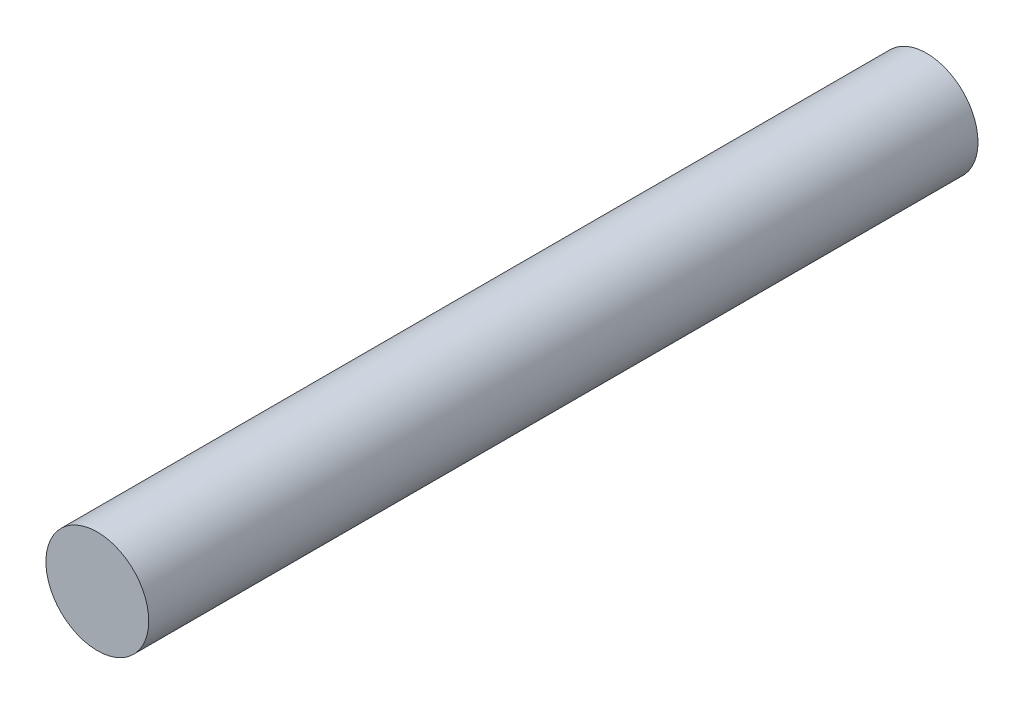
from build123d import *

# Parameters (mm, degrees)
SKETCH1_R      = 0.7874
EXTRUDE1_DEPTH = 12.7


with BuildPart() as part:
    # Sketch1 → Extrude1 (new body)
    with BuildSketch(Plane.XY):
        Circle(SKETCH1_R)
    extrude(amount=EXTRUDE1_DEPTH)


solid = part.part
